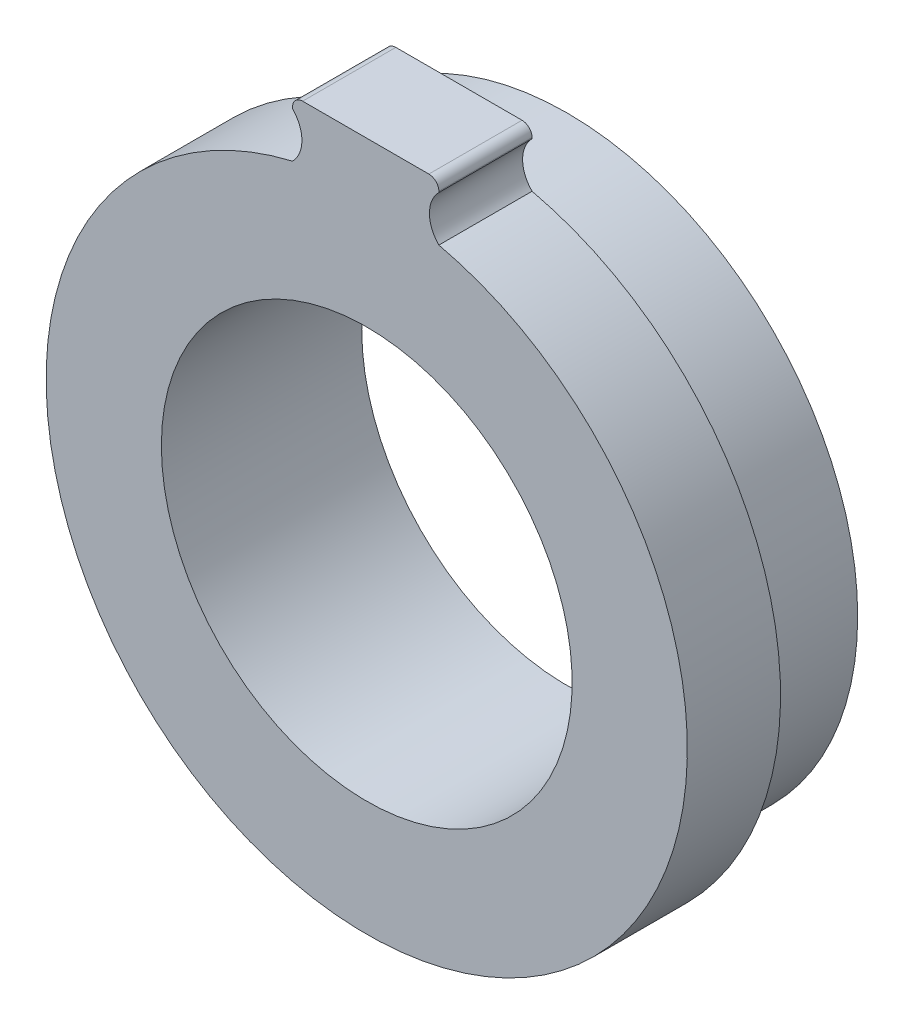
ISO-10303-21;
HEADER;
FILE_DESCRIPTION(('STEP AP214'),'2;1');
FILE_NAME('part.step','',(''),(''),'','','');
FILE_SCHEMA(('AUTOMOTIVE_DESIGN { 1 0 10303 214 1 1 1 1 }'));
ENDSEC;
DATA;
#1=APPLICATION_CONTEXT('core data for automotive mechanical design processes');
#2=APPLICATION_PROTOCOL_DEFINITION('international standard','automotive_design',2000,#1);
#3=PRODUCT_CONTEXT('',#1,'mechanical');
#4=PRODUCT('Part','Part','',(#3));
#5=PRODUCT_RELATED_PRODUCT_CATEGORY('part','',(#4));
#6=PRODUCT_DEFINITION_FORMATION('','',#4);
#7=PRODUCT_DEFINITION_CONTEXT('part definition',#1,'design');
#8=PRODUCT_DEFINITION('design','',#6,#7);
#9=PRODUCT_DEFINITION_SHAPE('','',#8);
#10=(LENGTH_UNIT() NAMED_UNIT(*) SI_UNIT(.MILLI.,.METRE.));
#11=(NAMED_UNIT(*) PLANE_ANGLE_UNIT() SI_UNIT($,.RADIAN.));
#12=(NAMED_UNIT(*) SI_UNIT($,.STERADIAN.) SOLID_ANGLE_UNIT());
#13=UNCERTAINTY_MEASURE_WITH_UNIT(LENGTH_MEASURE(1.E-05),#10,'distance_accuracy_value','');
#14=(GEOMETRIC_REPRESENTATION_CONTEXT(3) GLOBAL_UNCERTAINTY_ASSIGNED_CONTEXT((#13)) GLOBAL_UNIT_ASSIGNED_CONTEXT((#10,
#11,#12)) REPRESENTATION_CONTEXT('',''));
#15=CARTESIAN_POINT('',(0.,0.,0.));
#16=DIRECTION('',(0.,0.,1.));
#17=DIRECTION('',(1.,0.,0.));
#18=AXIS2_PLACEMENT_3D('',#15,#16,#17);
#19=CARTESIAN_POINT('',(0.,0.,1.30000000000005));
#20=DIRECTION('',(0.,0.,-1.));
#21=DIRECTION('',(-1.,0.,0.));
#22=AXIS2_PLACEMENT_3D('',#19,#20,#21);
#23=CYLINDRICAL_SURFACE('',#22,16.);
#24=CARTESIAN_POINT('',(0.,0.,1.30000000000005));
#25=DIRECTION('',(0.,0.,1.));
#26=DIRECTION('',(1.,0.,0.));
#27=AXIS2_PLACEMENT_3D('',#24,#25,#26);
#28=CIRCLE('',#27,16.);
#29=CARTESIAN_POINT('',(-3.7,15.5663097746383,1.30000000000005));
#30=VERTEX_POINT('',#29);
#31=CARTESIAN_POINT('',(3.6,15.5897402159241,1.30000000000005));
#32=VERTEX_POINT('',#31);
#33=EDGE_CURVE('E118',#30,#32,#28,.T.);
#34=ORIENTED_EDGE('',*,*,#33,.F.);
#35=DIRECTION('',(0.,0.,-1.));
#36=VECTOR('',#35,1.);
#37=CARTESIAN_POINT('',(-3.7,15.5663097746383,1.30000000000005));
#38=LINE('',#37,#36);
#39=CARTESIAN_POINT('',(-3.7,15.5663097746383,-3.34999999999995));
#40=VERTEX_POINT('',#39);
#41=EDGE_CURVE('E133',#30,#40,#38,.T.);
#42=ORIENTED_EDGE('',*,*,#41,.T.);
#43=CARTESIAN_POINT('',(0.,0.,-3.34999999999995));
#44=DIRECTION('',(0.,0.,1.));
#45=DIRECTION('',(1.,0.,0.));
#46=AXIS2_PLACEMENT_3D('',#43,#44,#45);
#47=CIRCLE('',#46,16.);
#48=CARTESIAN_POINT('',(3.6,15.5897402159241,-3.34999999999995));
#49=VERTEX_POINT('',#48);
#50=EDGE_CURVE('E145',#40,#49,#47,.T.);
#51=ORIENTED_EDGE('',*,*,#50,.T.);
#52=DIRECTION('',(0.,0.,-1.));
#53=VECTOR('',#52,1.);
#54=CARTESIAN_POINT('',(3.6,15.5897402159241,1.30000000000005));
#55=LINE('',#54,#53);
#56=EDGE_CURVE('E131',#49,#32,#55,.F.);
#57=ORIENTED_EDGE('',*,*,#56,.T.);
#58=EDGE_LOOP('',(#34,#42,#51,#57));
#59=FACE_BOUND('',#58,.T.);
#60=ADVANCED_FACE('F35',(#59),#23,.T.);
#61=CARTESIAN_POINT('',(0.,0.,1.30000000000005));
#62=DIRECTION('',(0.,0.,1.));
#63=DIRECTION('',(1.,0.,0.));
#64=AXIS2_PLACEMENT_3D('',#61,#62,#63);
#65=PLANE('',#64);
#66=DIRECTION('',(0.,1.,0.));
#67=VECTOR('',#66,1.);
#68=CARTESIAN_POINT('',(3.6,13.1,1.30000000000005));
#69=LINE('',#68,#67);
#70=CARTESIAN_POINT('',(3.6,17.8597328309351,1.30000000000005));
#71=VERTEX_POINT('',#70);
#72=CARTESIAN_POINT('',(3.6,17.9090136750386,1.30000000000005));
#73=VERTEX_POINT('',#72);
#74=EDGE_CURVE('E114',#71,#73,#69,.T.);
#75=ORIENTED_EDGE('',*,*,#74,.T.);
#76=CARTESIAN_POINT('',(3.1,17.9090136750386,1.30000000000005));
#77=DIRECTION('',(0.,0.,1.));
#78=DIRECTION('',(1.,0.,0.));
#79=AXIS2_PLACEMENT_3D('',#76,#77,#78);
#80=CIRCLE('',#79,0.5);
#81=CARTESIAN_POINT('',(3.1,18.4090136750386,1.30000000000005));
#82=VERTEX_POINT('',#81);
#83=EDGE_CURVE('E43',#73,#82,#80,.T.);
#84=ORIENTED_EDGE('',*,*,#83,.T.);
#85=DIRECTION('',(1.,0.,0.));
#86=VECTOR('',#85,1.);
#87=CARTESIAN_POINT('',(-4.1711997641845,18.4090136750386,1.30000000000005));
#88=LINE('',#87,#86);
#89=CARTESIAN_POINT('',(-3.2,18.4090136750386,1.30000000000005));
#90=VERTEX_POINT('',#89);
#91=EDGE_CURVE('E165',#90,#82,#88,.T.);
#92=ORIENTED_EDGE('',*,*,#91,.F.);
#93=CARTESIAN_POINT('',(-3.2,17.9090136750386,1.30000000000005));
#94=DIRECTION('',(0.,0.,1.));
#95=DIRECTION('',(1.,0.,0.));
#96=AXIS2_PLACEMENT_3D('',#93,#94,#95);
#97=CIRCLE('',#96,0.5);
#98=CARTESIAN_POINT('',(-3.7,17.9090136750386,1.30000000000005));
#99=VERTEX_POINT('',#98);
#100=EDGE_CURVE('E50',#90,#99,#97,.T.);
#101=ORIENTED_EDGE('',*,*,#100,.T.);
#102=DIRECTION('',(0.,-1.,0.));
#103=VECTOR('',#102,1.);
#104=CARTESIAN_POINT('',(-3.7,13.1,1.30000000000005));
#105=LINE('',#104,#103);
#106=CARTESIAN_POINT('',(-3.7,17.8217772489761,1.30000000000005));
#107=VERTEX_POINT('',#106);
#108=EDGE_CURVE('E123',#99,#107,#105,.T.);
#109=ORIENTED_EDGE('',*,*,#108,.T.);
#110=CARTESIAN_POINT('',(-4.8349963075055,16.6940435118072,1.30000000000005));
#111=DIRECTION('',(0.,0.,1.));
#112=DIRECTION('',(1.,0.,0.));
#113=AXIS2_PLACEMENT_3D('',#110,#111,#112);
#114=CIRCLE('',#113,1.6);
#115=EDGE_CURVE('E180',#30,#107,#114,.T.);
#116=ORIENTED_EDGE('',*,*,#115,.F.);
#117=ORIENTED_EDGE('',*,*,#33,.T.);
#118=CARTESIAN_POINT('',(4.72773373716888,16.7247365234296,1.30000000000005));
#119=DIRECTION('',(0.,0.,1.));
#120=DIRECTION('',(1.,0.,0.));
#121=AXIS2_PLACEMENT_3D('',#118,#119,#120);
#122=CIRCLE('',#121,1.6);
#123=EDGE_CURVE('E103',#71,#32,#122,.T.);
#124=ORIENTED_EDGE('',*,*,#123,.F.);
#125=EDGE_LOOP('',(#75,#84,#92,#101,#109,#116,#117,#124));
#126=FACE_BOUND('',#125,.T.);
#127=CARTESIAN_POINT('',(0.,0.,1.30000000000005));
#128=DIRECTION('',(0.,0.,-1.));
#129=DIRECTION('',(-1.,0.,0.));
#130=AXIS2_PLACEMENT_3D('',#127,#128,#129);
#131=CIRCLE('',#130,10.25);
#132=CARTESIAN_POINT('',(-10.25,0.,1.30000000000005));
#133=VERTEX_POINT('',#132);
#134=EDGE_CURVE('E137',#133,#133,#131,.T.);
#135=ORIENTED_EDGE('',*,*,#134,.T.);
#136=EDGE_LOOP('',(#135));
#137=FACE_BOUND('',#136,.T.);
#138=ADVANCED_FACE('F112',(#126,#137),#65,.T.);
#139=CARTESIAN_POINT('',(0.,0.,-3.34999999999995));
#140=DIRECTION('',(0.,0.,1.));
#141=DIRECTION('',(1.,0.,0.));
#142=AXIS2_PLACEMENT_3D('',#139,#140,#141);
#143=PLANE('',#142);
#144=CARTESIAN_POINT('',(0.,0.,-3.34999999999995));
#145=DIRECTION('',(0.,0.,1.));
#146=DIRECTION('',(1.,0.,0.));
#147=AXIS2_PLACEMENT_3D('',#144,#145,#146);
#148=CIRCLE('',#147,14.5);
#149=CARTESIAN_POINT('',(14.5,0.,-3.34999999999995));
#150=VERTEX_POINT('',#149);
#151=EDGE_CURVE('E147',#150,#150,#148,.F.);
#152=ORIENTED_EDGE('',*,*,#151,.F.);
#153=EDGE_LOOP('',(#152));
#154=FACE_BOUND('',#153,.T.);
#155=DIRECTION('',(1.,0.,0.));
#156=VECTOR('',#155,1.);
#157=CARTESIAN_POINT('',(0.,18.4090136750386,-3.34999999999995));
#158=LINE('',#157,#156);
#159=CARTESIAN_POINT('',(-3.2,18.4090136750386,-3.34999999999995));
#160=VERTEX_POINT('',#159);
#161=CARTESIAN_POINT('',(3.1,18.4090136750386,-3.34999999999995));
#162=VERTEX_POINT('',#161);
#163=EDGE_CURVE('E119',#160,#162,#158,.T.);
#164=ORIENTED_EDGE('',*,*,#163,.T.);
#165=CARTESIAN_POINT('',(3.1,17.9090136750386,-3.34999999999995));
#166=DIRECTION('',(0.,0.,1.));
#167=DIRECTION('',(1.,0.,0.));
#168=AXIS2_PLACEMENT_3D('',#165,#166,#167);
#169=CIRCLE('',#168,0.5);
#170=CARTESIAN_POINT('',(3.6,17.9090136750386,-3.34999999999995));
#171=VERTEX_POINT('',#170);
#172=EDGE_CURVE('E161',#162,#171,#169,.F.);
#173=ORIENTED_EDGE('',*,*,#172,.T.);
#174=DIRECTION('',(0.,1.,0.));
#175=VECTOR('',#174,1.);
#176=CARTESIAN_POINT('',(3.6,13.1,-3.34999999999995));
#177=LINE('',#176,#175);
#178=CARTESIAN_POINT('',(3.6,17.8597328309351,-3.34999999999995));
#179=VERTEX_POINT('',#178);
#180=EDGE_CURVE('E125',#179,#171,#177,.T.);
#181=ORIENTED_EDGE('',*,*,#180,.F.);
#182=CARTESIAN_POINT('',(4.72773373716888,16.7247365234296,-3.34999999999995));
#183=DIRECTION('',(0.,0.,1.));
#184=DIRECTION('',(1.,0.,0.));
#185=AXIS2_PLACEMENT_3D('',#182,#183,#184);
#186=CIRCLE('',#185,1.6);
#187=EDGE_CURVE('E106',#179,#49,#186,.T.);
#188=ORIENTED_EDGE('',*,*,#187,.T.);
#189=ORIENTED_EDGE('',*,*,#50,.F.);
#190=CARTESIAN_POINT('',(-4.8349963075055,16.6940435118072,-3.34999999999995));
#191=DIRECTION('',(0.,0.,1.));
#192=DIRECTION('',(1.,0.,0.));
#193=AXIS2_PLACEMENT_3D('',#190,#191,#192);
#194=CIRCLE('',#193,1.6);
#195=CARTESIAN_POINT('',(-3.7,17.8217772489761,-3.34999999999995));
#196=VERTEX_POINT('',#195);
#197=EDGE_CURVE('E127',#40,#196,#194,.T.);
#198=ORIENTED_EDGE('',*,*,#197,.T.);
#199=DIRECTION('',(0.,-1.,0.));
#200=VECTOR('',#199,1.);
#201=CARTESIAN_POINT('',(-3.7,13.1,-3.34999999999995));
#202=LINE('',#201,#200);
#203=CARTESIAN_POINT('',(-3.7,17.9090136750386,-3.34999999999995));
#204=VERTEX_POINT('',#203);
#205=EDGE_CURVE('E122',#204,#196,#202,.T.);
#206=ORIENTED_EDGE('',*,*,#205,.F.);
#207=CARTESIAN_POINT('',(-3.2,17.9090136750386,-3.34999999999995));
#208=DIRECTION('',(0.,0.,1.));
#209=DIRECTION('',(1.,0.,0.));
#210=AXIS2_PLACEMENT_3D('',#207,#208,#209);
#211=CIRCLE('',#210,0.5);
#212=EDGE_CURVE('E159',#204,#160,#211,.F.);
#213=ORIENTED_EDGE('',*,*,#212,.T.);
#214=EDGE_LOOP('',(#164,#173,#181,#188,#189,#198,#206,#213));
#215=FACE_BOUND('',#214,.T.);
#216=ADVANCED_FACE('F176',(#154,#215),#143,.F.);
#217=CARTESIAN_POINT('',(0.,0.,-8.69999999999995));
#218=DIRECTION('',(0.,0.,1.));
#219=DIRECTION('',(1.,0.,0.));
#220=AXIS2_PLACEMENT_3D('',#217,#218,#219);
#221=CYLINDRICAL_SURFACE('',#220,14.5);
#222=CARTESIAN_POINT('',(0.,0.,-8.69999999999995));
#223=DIRECTION('',(0.,0.,-1.));
#224=DIRECTION('',(-1.,0.,0.));
#225=AXIS2_PLACEMENT_3D('',#222,#223,#224);
#226=CIRCLE('',#225,14.5);
#227=CARTESIAN_POINT('',(-14.5,0.,-8.69999999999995));
#228=VERTEX_POINT('',#227);
#229=EDGE_CURVE('E140',#228,#228,#226,.T.);
#230=ORIENTED_EDGE('',*,*,#229,.F.);
#231=EDGE_LOOP('',(#230));
#232=FACE_BOUND('',#231,.T.);
#233=ORIENTED_EDGE('',*,*,#151,.T.);
#234=EDGE_LOOP('',(#233));
#235=FACE_BOUND('',#234,.T.);
#236=ADVANCED_FACE('F207',(#232,#235),#221,.T.);
#237=CARTESIAN_POINT('',(0.,0.,-8.69999999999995));
#238=DIRECTION('',(0.,0.,-1.));
#239=DIRECTION('',(-1.,0.,0.));
#240=AXIS2_PLACEMENT_3D('',#237,#238,#239);
#241=PLANE('',#240);
#242=CARTESIAN_POINT('',(0.,0.,-8.69999999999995));
#243=DIRECTION('',(0.,0.,-1.));
#244=DIRECTION('',(-1.,0.,0.));
#245=AXIS2_PLACEMENT_3D('',#242,#243,#244);
#246=CIRCLE('',#245,10.25);
#247=CARTESIAN_POINT('',(-10.25,0.,-8.69999999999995));
#248=VERTEX_POINT('',#247);
#249=EDGE_CURVE('E136',#248,#248,#246,.T.);
#250=ORIENTED_EDGE('',*,*,#249,.F.);
#251=EDGE_LOOP('',(#250));
#252=FACE_BOUND('',#251,.T.);
#253=ORIENTED_EDGE('',*,*,#229,.T.);
#254=EDGE_LOOP('',(#253));
#255=FACE_BOUND('',#254,.T.);
#256=ADVANCED_FACE('F212',(#252,#255),#241,.T.);
#257=CARTESIAN_POINT('',(0.,0.,1.30000000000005));
#258=DIRECTION('',(0.,0.,-1.));
#259=DIRECTION('',(-1.,0.,0.));
#260=AXIS2_PLACEMENT_3D('',#257,#258,#259);
#261=CYLINDRICAL_SURFACE('',#260,10.25);
#262=ORIENTED_EDGE('',*,*,#134,.F.);
#263=EDGE_LOOP('',(#262));
#264=FACE_BOUND('',#263,.T.);
#265=ORIENTED_EDGE('',*,*,#249,.T.);
#266=EDGE_LOOP('',(#265));
#267=FACE_BOUND('',#266,.T.);
#268=ADVANCED_FACE('F216',(#264,#267),#261,.F.);
#269=CARTESIAN_POINT('',(-3.7,13.1,-3.34999999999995));
#270=DIRECTION('',(-1.,0.,0.));
#271=DIRECTION('',(0.,0.,1.));
#272=AXIS2_PLACEMENT_3D('',#269,#270,#271);
#273=PLANE('',#272);
#274=ORIENTED_EDGE('',*,*,#108,.F.);
#275=DIRECTION('',(0.,0.,1.));
#276=VECTOR('',#275,1.);
#277=CARTESIAN_POINT('',(-3.7,17.9090136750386,-8.69999999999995));
#278=LINE('',#277,#276);
#279=EDGE_CURVE('E11',#99,#204,#278,.F.);
#280=ORIENTED_EDGE('',*,*,#279,.T.);
#281=ORIENTED_EDGE('',*,*,#205,.T.);
#282=DIRECTION('',(0.,0.,1.));
#283=VECTOR('',#282,1.);
#284=CARTESIAN_POINT('',(-3.7,17.8217772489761,-8.69999999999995));
#285=LINE('',#284,#283);
#286=EDGE_CURVE('E109',#107,#196,#285,.F.);
#287=ORIENTED_EDGE('',*,*,#286,.F.);
#288=EDGE_LOOP('',(#274,#280,#281,#287));
#289=FACE_BOUND('',#288,.T.);
#290=ADVANCED_FACE('F191',(#289),#273,.T.);
#291=CARTESIAN_POINT('',(3.6,13.1,-3.34999999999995));
#292=DIRECTION('',(1.,0.,0.));
#293=DIRECTION('',(0.,0.,-1.));
#294=AXIS2_PLACEMENT_3D('',#291,#292,#293);
#295=PLANE('',#294);
#296=ORIENTED_EDGE('',*,*,#180,.T.);
#297=DIRECTION('',(0.,0.,-1.));
#298=VECTOR('',#297,1.);
#299=CARTESIAN_POINT('',(3.6,17.9090136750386,-8.69999999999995));
#300=LINE('',#299,#298);
#301=EDGE_CURVE('E58',#171,#73,#300,.F.);
#302=ORIENTED_EDGE('',*,*,#301,.T.);
#303=ORIENTED_EDGE('',*,*,#74,.F.);
#304=DIRECTION('',(0.,0.,1.));
#305=VECTOR('',#304,1.);
#306=CARTESIAN_POINT('',(3.6,17.8597328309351,-8.69999999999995));
#307=LINE('',#306,#305);
#308=EDGE_CURVE('E100',#179,#71,#307,.T.);
#309=ORIENTED_EDGE('',*,*,#308,.F.);
#310=EDGE_LOOP('',(#296,#302,#303,#309));
#311=FACE_BOUND('',#310,.T.);
#312=ADVANCED_FACE('F121',(#311),#295,.T.);
#313=CARTESIAN_POINT('',(-4.8349963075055,16.6940435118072,-8.69999999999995));
#314=DIRECTION('',(0.,0.,1.));
#315=DIRECTION('',(1.,0.,0.));
#316=AXIS2_PLACEMENT_3D('',#313,#314,#315);
#317=CYLINDRICAL_SURFACE('',#316,1.6);
#318=ORIENTED_EDGE('',*,*,#41,.F.);
#319=ORIENTED_EDGE('',*,*,#115,.T.);
#320=ORIENTED_EDGE('',*,*,#286,.T.);
#321=ORIENTED_EDGE('',*,*,#197,.F.);
#322=EDGE_LOOP('',(#318,#319,#320,#321));
#323=FACE_BOUND('',#322,.T.);
#324=ADVANCED_FACE('F187',(#323),#317,.F.);
#325=CARTESIAN_POINT('',(4.72773373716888,16.7247365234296,-8.69999999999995));
#326=DIRECTION('',(0.,0.,1.));
#327=DIRECTION('',(1.,0.,0.));
#328=AXIS2_PLACEMENT_3D('',#325,#326,#327);
#329=CYLINDRICAL_SURFACE('',#328,1.6);
#330=ORIENTED_EDGE('',*,*,#308,.T.);
#331=ORIENTED_EDGE('',*,*,#123,.T.);
#332=ORIENTED_EDGE('',*,*,#56,.F.);
#333=ORIENTED_EDGE('',*,*,#187,.F.);
#334=EDGE_LOOP('',(#330,#331,#332,#333));
#335=FACE_BOUND('',#334,.T.);
#336=ADVANCED_FACE('F102',(#335),#329,.F.);
#337=CARTESIAN_POINT('',(-4.1711997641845,18.4090136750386,-8.69999999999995));
#338=DIRECTION('',(0.,-1.,0.));
#339=DIRECTION('',(0.,0.,-1.));
#340=AXIS2_PLACEMENT_3D('',#337,#338,#339);
#341=PLANE('',#340);
#342=ORIENTED_EDGE('',*,*,#91,.T.);
#343=DIRECTION('',(0.,0.,-1.));
#344=VECTOR('',#343,1.);
#345=CARTESIAN_POINT('',(3.1,18.4090136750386,-8.69999999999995));
#346=LINE('',#345,#344);
#347=EDGE_CURVE('E156',#82,#162,#346,.T.);
#348=ORIENTED_EDGE('',*,*,#347,.T.);
#349=ORIENTED_EDGE('',*,*,#163,.F.);
#350=DIRECTION('',(0.,0.,1.));
#351=VECTOR('',#350,1.);
#352=CARTESIAN_POINT('',(-3.2,18.4090136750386,-8.69999999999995));
#353=LINE('',#352,#351);
#354=EDGE_CURVE('E108',#160,#90,#353,.T.);
#355=ORIENTED_EDGE('',*,*,#354,.T.);
#356=EDGE_LOOP('',(#342,#348,#349,#355));
#357=FACE_BOUND('',#356,.T.);
#358=ADVANCED_FACE('F169',(#357),#341,.F.);
#359=CARTESIAN_POINT('',(3.1,17.9090136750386,-8.69999999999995));
#360=DIRECTION('',(0.,0.,1.));
#361=DIRECTION('',(1.,0.,0.));
#362=AXIS2_PLACEMENT_3D('',#359,#360,#361);
#363=CYLINDRICAL_SURFACE('',#362,0.5);
#364=ORIENTED_EDGE('',*,*,#83,.F.);
#365=ORIENTED_EDGE('',*,*,#301,.F.);
#366=ORIENTED_EDGE('',*,*,#172,.F.);
#367=ORIENTED_EDGE('',*,*,#347,.F.);
#368=EDGE_LOOP('',(#364,#365,#366,#367));
#369=FACE_BOUND('',#368,.T.);
#370=ADVANCED_FACE('F174',(#369),#363,.T.);
#371=CARTESIAN_POINT('',(-3.2,17.9090136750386,-8.69999999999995));
#372=DIRECTION('',(0.,0.,-1.));
#373=DIRECTION('',(-1.,0.,0.));
#374=AXIS2_PLACEMENT_3D('',#371,#372,#373);
#375=CYLINDRICAL_SURFACE('',#374,0.5);
#376=ORIENTED_EDGE('',*,*,#212,.F.);
#377=ORIENTED_EDGE('',*,*,#279,.F.);
#378=ORIENTED_EDGE('',*,*,#100,.F.);
#379=ORIENTED_EDGE('',*,*,#354,.F.);
#380=EDGE_LOOP('',(#376,#377,#378,#379));
#381=FACE_BOUND('',#380,.T.);
#382=ADVANCED_FACE('F37',(#381),#375,.T.);
#383=CLOSED_SHELL('',(#60,#138,#216,#236,#256,#268,#290,#312,#324,#336,#358,#370,#382));
#384=MANIFOLD_SOLID_BREP('B2',#383);
#385=ADVANCED_BREP_SHAPE_REPRESENTATION('',(#18,#384),#14);
#386=SHAPE_DEFINITION_REPRESENTATION(#9,#385);
ENDSEC;
END-ISO-10303-21;
